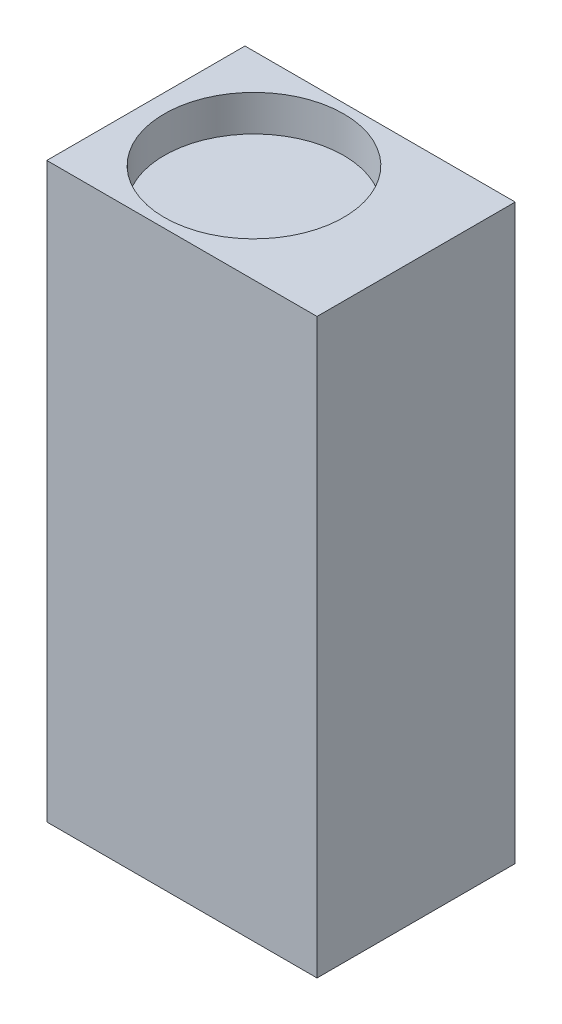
ISO-10303-21;
HEADER;
FILE_DESCRIPTION(('STEP AP214'),'2;1');
FILE_NAME('part.step','',(''),(''),'','','');
FILE_SCHEMA(('AUTOMOTIVE_DESIGN { 1 0 10303 214 1 1 1 1 }'));
ENDSEC;
DATA;
#1=APPLICATION_CONTEXT('core data for automotive mechanical design processes');
#2=APPLICATION_PROTOCOL_DEFINITION('international standard','automotive_design',2000,#1);
#3=PRODUCT_CONTEXT('',#1,'mechanical');
#4=PRODUCT('Part','Part','',(#3));
#5=PRODUCT_RELATED_PRODUCT_CATEGORY('part','',(#4));
#6=PRODUCT_DEFINITION_FORMATION('','',#4);
#7=PRODUCT_DEFINITION_CONTEXT('part definition',#1,'design');
#8=PRODUCT_DEFINITION('design','',#6,#7);
#9=PRODUCT_DEFINITION_SHAPE('','',#8);
#10=(LENGTH_UNIT() NAMED_UNIT(*) SI_UNIT(.MILLI.,.METRE.));
#11=(NAMED_UNIT(*) PLANE_ANGLE_UNIT() SI_UNIT($,.RADIAN.));
#12=(NAMED_UNIT(*) SI_UNIT($,.STERADIAN.) SOLID_ANGLE_UNIT());
#13=UNCERTAINTY_MEASURE_WITH_UNIT(LENGTH_MEASURE(1.E-05),#10,'distance_accuracy_value','');
#14=(GEOMETRIC_REPRESENTATION_CONTEXT(3) GLOBAL_UNCERTAINTY_ASSIGNED_CONTEXT((#13)) GLOBAL_UNIT_ASSIGNED_CONTEXT((#10,
#11,#12)) REPRESENTATION_CONTEXT('',''));
#15=CARTESIAN_POINT('',(0.,0.,0.));
#16=DIRECTION('',(0.,0.,1.));
#17=DIRECTION('',(1.,0.,0.));
#18=AXIS2_PLACEMENT_3D('',#15,#16,#17);
#19=CARTESIAN_POINT('',(-38.1,0.,34.925));
#20=DIRECTION('',(1.,0.,0.));
#21=DIRECTION('',(0.,1.,0.));
#22=AXIS2_PLACEMENT_3D('',#19,#20,#21);
#23=PLANE('',#22);
#24=DIRECTION('',(0.,-1.,0.));
#25=VECTOR('',#24,1.);
#26=CARTESIAN_POINT('',(-38.1,0.,-34.925));
#27=LINE('',#26,#25);
#28=CARTESIAN_POINT('',(-38.1,0.,-34.925));
#29=VERTEX_POINT('',#28);
#30=CARTESIAN_POINT('',(-38.1,-201.93,-34.925));
#31=VERTEX_POINT('',#30);
#32=EDGE_CURVE('E115',#29,#31,#27,.T.);
#33=ORIENTED_EDGE('',*,*,#32,.T.);
#34=DIRECTION('',(0.,0.,-1.));
#35=VECTOR('',#34,1.);
#36=CARTESIAN_POINT('',(-38.1,-201.93,34.925));
#37=LINE('',#36,#35);
#38=CARTESIAN_POINT('',(-38.1,-201.93,34.925));
#39=VERTEX_POINT('',#38);
#40=EDGE_CURVE('E11',#39,#31,#37,.T.);
#41=ORIENTED_EDGE('',*,*,#40,.F.);
#42=DIRECTION('',(0.,-1.,0.));
#43=VECTOR('',#42,1.);
#44=CARTESIAN_POINT('',(-38.1,0.,34.925));
#45=LINE('',#44,#43);
#46=CARTESIAN_POINT('',(-38.1,0.,34.925));
#47=VERTEX_POINT('',#46);
#48=EDGE_CURVE('E118',#47,#39,#45,.T.);
#49=ORIENTED_EDGE('',*,*,#48,.F.);
#50=DIRECTION('',(0.,0.,-1.));
#51=VECTOR('',#50,1.);
#52=CARTESIAN_POINT('',(-38.1,0.,34.925));
#53=LINE('',#52,#51);
#54=EDGE_CURVE('E124',#47,#29,#53,.T.);
#55=ORIENTED_EDGE('',*,*,#54,.T.);
#56=EDGE_LOOP('',(#33,#41,#49,#55));
#57=FACE_BOUND('',#56,.T.);
#58=ADVANCED_FACE('F36',(#57),#23,.F.);
#59=CARTESIAN_POINT('',(-38.1,-201.93,34.925));
#60=DIRECTION('',(0.,1.,0.));
#61=DIRECTION('',(0.,0.,1.));
#62=AXIS2_PLACEMENT_3D('',#59,#60,#61);
#63=PLANE('',#62);
#64=CARTESIAN_POINT('',(-25.4,-201.93,0.));
#65=DIRECTION('',(0.,-1.,0.));
#66=DIRECTION('',(0.,0.,-1.));
#67=AXIS2_PLACEMENT_3D('',#64,#65,#66);
#68=CIRCLE('',#67,3.96875);
#69=CARTESIAN_POINT('',(-25.4,-201.93,-3.96875));
#70=VERTEX_POINT('',#69);
#71=EDGE_CURVE('E101',#70,#70,#68,.T.);
#72=ORIENTED_EDGE('',*,*,#71,.F.);
#73=EDGE_LOOP('',(#72));
#74=FACE_BOUND('',#73,.T.);
#75=CARTESIAN_POINT('',(44.45,-201.93,0.));
#76=DIRECTION('',(0.,-1.,0.));
#77=DIRECTION('',(0.,0.,-1.));
#78=AXIS2_PLACEMENT_3D('',#75,#76,#77);
#79=CIRCLE('',#78,3.96875);
#80=CARTESIAN_POINT('',(44.45,-201.93,-3.96875));
#81=VERTEX_POINT('',#80);
#82=EDGE_CURVE('E100',#81,#81,#79,.T.);
#83=ORIENTED_EDGE('',*,*,#82,.F.);
#84=EDGE_LOOP('',(#83));
#85=FACE_BOUND('',#84,.T.);
#86=DIRECTION('',(1.,0.,0.));
#87=VECTOR('',#86,1.);
#88=CARTESIAN_POINT('',(-38.1,-201.93,-34.925));
#89=LINE('',#88,#87);
#90=CARTESIAN_POINT('',(57.15,-201.93,-34.925));
#91=VERTEX_POINT('',#90);
#92=EDGE_CURVE('E127',#31,#91,#89,.T.);
#93=ORIENTED_EDGE('',*,*,#92,.T.);
#94=DIRECTION('',(0.,0.,-1.));
#95=VECTOR('',#94,1.);
#96=CARTESIAN_POINT('',(57.15,-201.93,34.925));
#97=LINE('',#96,#95);
#98=CARTESIAN_POINT('',(57.15,-201.93,34.925));
#99=VERTEX_POINT('',#98);
#100=EDGE_CURVE('E44',#99,#91,#97,.T.);
#101=ORIENTED_EDGE('',*,*,#100,.F.);
#102=DIRECTION('',(1.,0.,0.));
#103=VECTOR('',#102,1.);
#104=CARTESIAN_POINT('',(-38.1,-201.93,34.925));
#105=LINE('',#104,#103);
#106=EDGE_CURVE('E83',#39,#99,#105,.T.);
#107=ORIENTED_EDGE('',*,*,#106,.F.);
#108=ORIENTED_EDGE('',*,*,#40,.T.);
#109=EDGE_LOOP('',(#93,#101,#107,#108));
#110=FACE_BOUND('',#109,.T.);
#111=ADVANCED_FACE('F151',(#74,#85,#110),#63,.F.);
#112=CARTESIAN_POINT('',(57.15,0.,34.925));
#113=DIRECTION('',(-1.,0.,0.));
#114=DIRECTION('',(0.,-1.,0.));
#115=AXIS2_PLACEMENT_3D('',#112,#113,#114);
#116=PLANE('',#115);
#117=DIRECTION('',(0.,1.,0.));
#118=VECTOR('',#117,1.);
#119=CARTESIAN_POINT('',(57.15,0.,-34.925));
#120=LINE('',#119,#118);
#121=CARTESIAN_POINT('',(57.15,0.,-34.925));
#122=VERTEX_POINT('',#121);
#123=EDGE_CURVE('E70',#91,#122,#120,.T.);
#124=ORIENTED_EDGE('',*,*,#123,.T.);
#125=DIRECTION('',(0.,0.,-1.));
#126=VECTOR('',#125,1.);
#127=CARTESIAN_POINT('',(57.15,0.,34.925));
#128=LINE('',#127,#126);
#129=CARTESIAN_POINT('',(57.15,0.,34.925));
#130=VERTEX_POINT('',#129);
#131=EDGE_CURVE('E132',#130,#122,#128,.T.);
#132=ORIENTED_EDGE('',*,*,#131,.F.);
#133=DIRECTION('',(0.,1.,0.));
#134=VECTOR('',#133,1.);
#135=CARTESIAN_POINT('',(57.15,0.,34.925));
#136=LINE('',#135,#134);
#137=EDGE_CURVE('E121',#99,#130,#136,.T.);
#138=ORIENTED_EDGE('',*,*,#137,.F.);
#139=ORIENTED_EDGE('',*,*,#100,.T.);
#140=EDGE_LOOP('',(#124,#132,#138,#139));
#141=FACE_BOUND('',#140,.T.);
#142=ADVANCED_FACE('F134',(#141),#116,.F.);
#143=CARTESIAN_POINT('',(-38.1,0.,34.925));
#144=DIRECTION('',(0.,-1.,0.));
#145=DIRECTION('',(0.,0.,-1.));
#146=AXIS2_PLACEMENT_3D('',#143,#144,#145);
#147=PLANE('',#146);
#148=CARTESIAN_POINT('',(0.,0.,0.));
#149=DIRECTION('',(0.,1.,0.));
#150=DIRECTION('',(0.,0.,1.));
#151=AXIS2_PLACEMENT_3D('',#148,#149,#150);
#152=CIRCLE('',#151,31.623);
#153=CARTESIAN_POINT('',(0.,0.,31.623));
#154=VERTEX_POINT('',#153);
#155=EDGE_CURVE('E111',#154,#154,#152,.T.);
#156=ORIENTED_EDGE('',*,*,#155,.F.);
#157=EDGE_LOOP('',(#156));
#158=FACE_BOUND('',#157,.T.);
#159=DIRECTION('',(-1.,0.,0.));
#160=VECTOR('',#159,1.);
#161=CARTESIAN_POINT('',(-38.1,0.,-34.925));
#162=LINE('',#161,#160);
#163=EDGE_CURVE('E76',#122,#29,#162,.T.);
#164=ORIENTED_EDGE('',*,*,#163,.T.);
#165=ORIENTED_EDGE('',*,*,#54,.F.);
#166=DIRECTION('',(-1.,0.,0.));
#167=VECTOR('',#166,1.);
#168=CARTESIAN_POINT('',(-38.1,0.,34.925));
#169=LINE('',#168,#167);
#170=EDGE_CURVE('E52',#130,#47,#169,.T.);
#171=ORIENTED_EDGE('',*,*,#170,.F.);
#172=ORIENTED_EDGE('',*,*,#131,.T.);
#173=EDGE_LOOP('',(#164,#165,#171,#172));
#174=FACE_BOUND('',#173,.T.);
#175=ADVANCED_FACE('F141',(#158,#174),#147,.F.);
#176=CARTESIAN_POINT('',(0.,0.,34.925));
#177=DIRECTION('',(0.,0.,1.));
#178=DIRECTION('',(1.,0.,0.));
#179=AXIS2_PLACEMENT_3D('',#176,#177,#178);
#180=PLANE('',#179);
#181=ORIENTED_EDGE('',*,*,#48,.T.);
#182=ORIENTED_EDGE('',*,*,#106,.T.);
#183=ORIENTED_EDGE('',*,*,#137,.T.);
#184=ORIENTED_EDGE('',*,*,#170,.T.);
#185=EDGE_LOOP('',(#181,#182,#183,#184));
#186=FACE_BOUND('',#185,.T.);
#187=ADVANCED_FACE('F143',(#186),#180,.T.);
#188=CARTESIAN_POINT('',(0.,0.,-34.925));
#189=DIRECTION('',(0.,0.,1.));
#190=DIRECTION('',(1.,0.,0.));
#191=AXIS2_PLACEMENT_3D('',#188,#189,#190);
#192=PLANE('',#191);
#193=ORIENTED_EDGE('',*,*,#32,.F.);
#194=ORIENTED_EDGE('',*,*,#163,.F.);
#195=ORIENTED_EDGE('',*,*,#123,.F.);
#196=ORIENTED_EDGE('',*,*,#92,.F.);
#197=EDGE_LOOP('',(#193,#194,#195,#196));
#198=FACE_BOUND('',#197,.T.);
#199=ADVANCED_FACE('F137',(#198),#192,.F.);
#200=CARTESIAN_POINT('',(0.,-12.7,0.));
#201=DIRECTION('',(0.,1.,0.));
#202=DIRECTION('',(0.,0.,1.));
#203=AXIS2_PLACEMENT_3D('',#200,#201,#202);
#204=CYLINDRICAL_SURFACE('',#203,31.623);
#205=CARTESIAN_POINT('',(0.,-12.7,0.));
#206=DIRECTION('',(0.,1.,0.));
#207=DIRECTION('',(0.,0.,1.));
#208=AXIS2_PLACEMENT_3D('',#205,#206,#207);
#209=CIRCLE('',#208,31.623);
#210=CARTESIAN_POINT('',(0.,-12.7,31.623));
#211=VERTEX_POINT('',#210);
#212=EDGE_CURVE('E112',#211,#211,#209,.T.);
#213=ORIENTED_EDGE('',*,*,#212,.F.);
#214=EDGE_LOOP('',(#213));
#215=FACE_BOUND('',#214,.T.);
#216=ORIENTED_EDGE('',*,*,#155,.T.);
#217=EDGE_LOOP('',(#216));
#218=FACE_BOUND('',#217,.T.);
#219=ADVANCED_FACE('F183',(#215,#218),#204,.F.);
#220=CARTESIAN_POINT('',(0.,-12.7,0.));
#221=DIRECTION('',(0.,1.,0.));
#222=DIRECTION('',(0.,0.,1.));
#223=AXIS2_PLACEMENT_3D('',#220,#221,#222);
#224=PLANE('',#223);
#225=ORIENTED_EDGE('',*,*,#212,.T.);
#226=EDGE_LOOP('',(#225));
#227=FACE_BOUND('',#226,.T.);
#228=ADVANCED_FACE('F175',(#227),#224,.T.);
#229=CARTESIAN_POINT('',(44.45,-178.1175,0.));
#230=DIRECTION('',(0.,-1.,0.));
#231=DIRECTION('',(0.,0.,-1.));
#232=AXIS2_PLACEMENT_3D('',#229,#230,#231);
#233=CONICAL_SURFACE('',#232,3.96874999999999,1.02974425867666);
#234=CARTESIAN_POINT('',(44.45,-175.732834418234,0.));
#235=VERTEX_POINT('',#234);
#236=VERTEX_LOOP('',#235);
#237=FACE_BOUND('',#236,.T.);
#238=CARTESIAN_POINT('',(44.45,-178.1175,0.));
#239=DIRECTION('',(0.,-1.,0.));
#240=DIRECTION('',(0.,0.,-1.));
#241=AXIS2_PLACEMENT_3D('',#238,#239,#240);
#242=CIRCLE('',#241,3.96874999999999);
#243=CARTESIAN_POINT('',(44.45,-178.1175,-3.96874999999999));
#244=VERTEX_POINT('',#243);
#245=EDGE_CURVE('E104',#244,#244,#242,.T.);
#246=ORIENTED_EDGE('',*,*,#245,.T.);
#247=EDGE_LOOP('',(#246));
#248=FACE_BOUND('',#247,.T.);
#249=ADVANCED_FACE('F169',(#237,#248),#233,.F.);
#250=CARTESIAN_POINT('',(44.45,-201.93,0.));
#251=DIRECTION('',(0.,-1.,0.));
#252=DIRECTION('',(0.,0.,-1.));
#253=AXIS2_PLACEMENT_3D('',#250,#251,#252);
#254=CYLINDRICAL_SURFACE('',#253,3.96875);
#255=ORIENTED_EDGE('',*,*,#245,.F.);
#256=EDGE_LOOP('',(#255));
#257=FACE_BOUND('',#256,.T.);
#258=ORIENTED_EDGE('',*,*,#82,.T.);
#259=EDGE_LOOP('',(#258));
#260=FACE_BOUND('',#259,.T.);
#261=ADVANCED_FACE('F94',(#257,#260),#254,.F.);
#262=CARTESIAN_POINT('',(-25.4,-178.1175,0.));
#263=DIRECTION('',(0.,-1.,0.));
#264=DIRECTION('',(0.,0.,-1.));
#265=AXIS2_PLACEMENT_3D('',#262,#263,#264);
#266=CONICAL_SURFACE('',#265,3.96875,1.02974425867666);
#267=CARTESIAN_POINT('',(-25.4,-175.732834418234,0.));
#268=VERTEX_POINT('',#267);
#269=VERTEX_LOOP('',#268);
#270=FACE_BOUND('',#269,.T.);
#271=CARTESIAN_POINT('',(-25.4,-178.1175,0.));
#272=DIRECTION('',(0.,-1.,0.));
#273=DIRECTION('',(0.,0.,-1.));
#274=AXIS2_PLACEMENT_3D('',#271,#272,#273);
#275=CIRCLE('',#274,3.96875);
#276=CARTESIAN_POINT('',(-25.4,-178.1175,-3.96875));
#277=VERTEX_POINT('',#276);
#278=EDGE_CURVE('E98',#277,#277,#275,.T.);
#279=ORIENTED_EDGE('',*,*,#278,.T.);
#280=EDGE_LOOP('',(#279));
#281=FACE_BOUND('',#280,.T.);
#282=ADVANCED_FACE('F90',(#270,#281),#266,.F.);
#283=CARTESIAN_POINT('',(-25.4,-201.93,0.));
#284=DIRECTION('',(0.,-1.,0.));
#285=DIRECTION('',(0.,0.,-1.));
#286=AXIS2_PLACEMENT_3D('',#283,#284,#285);
#287=CYLINDRICAL_SURFACE('',#286,3.96875);
#288=ORIENTED_EDGE('',*,*,#278,.F.);
#289=EDGE_LOOP('',(#288));
#290=FACE_BOUND('',#289,.T.);
#291=ORIENTED_EDGE('',*,*,#71,.T.);
#292=EDGE_LOOP('',(#291));
#293=FACE_BOUND('',#292,.T.);
#294=ADVANCED_FACE('F93',(#290,#293),#287,.F.);
#295=CLOSED_SHELL('',(#58,#111,#142,#175,#187,#199,#219,#228,#249,#261,#282,#294));
#296=MANIFOLD_SOLID_BREP('B2',#295);
#297=ADVANCED_BREP_SHAPE_REPRESENTATION('',(#18,#296),#14);
#298=SHAPE_DEFINITION_REPRESENTATION(#9,#297);
ENDSEC;
END-ISO-10303-21;
